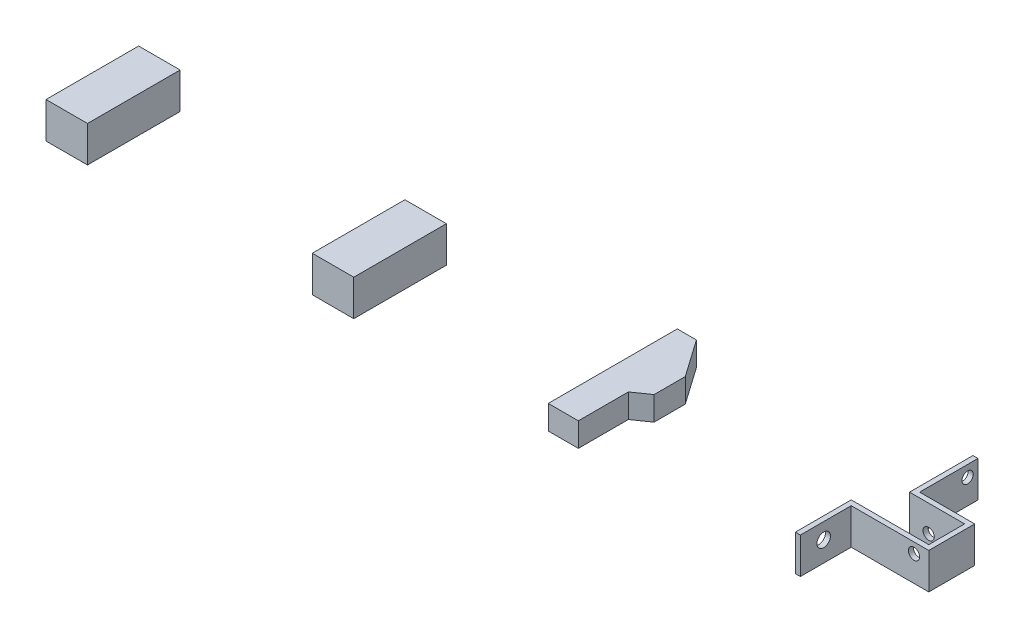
from build123d import *

# Parameters (mm, degrees)
SKETCH10_W          = 104.860369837
SKETCH10_H          = 234.156165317
EXTRUDE2_DEPTH      = 90.932
SKETCH12_W          = 104.860369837
SKETCH12_H          = 234.156165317
EXTRUDE3_DEPTH      = 90.932
EXTRUDE4_DEPTH      = 60.452
EXTRUDE_THIN1_DEPTH = 90.932
SKETCH19_R          = 17.151740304
CUT_EXTRUDE1_DEPTH  = 12.7
SKETCH20_R          = 14.265938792
CUT_EXTRUDE2_DEPTH  = 12.7
SKETCH21_R          = 14.265938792
CUT_EXTRUDE3_DEPTH  = 12.7
SKETCH22_R          = 14.265938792
CUT_EXTRUDE4_DEPTH  = 12.7


with BuildPart() as part:
    # Sketch10 → Extrude2 (new body)
    with BuildSketch(Plane(origin=(0, 0, 0), x_dir=(1, 0, 0), z_dir=(0, 1, 0))):
        with Locations((896.393212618, 117.078082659)):
            Rectangle(SKETCH10_W, SKETCH10_H)
    extrude(amount=EXTRUDE2_DEPTH)


with BuildPart() as body_2:
    # Sketch12 → Extrude3 (new body)
    with BuildSketch(Plane(origin=(0, 0, 0), x_dir=(1, 0, 0), z_dir=(0, 1, 0))):
        with Locations((1569.377756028, 117.078082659)):
            Rectangle(SKETCH12_W, SKETCH12_H)
    extrude(amount=EXTRUDE3_DEPTH)


with BuildPart() as body_3:
    # Sketch14 → Extrude4 (new body)
    with BuildSketch(Plane(origin=(0, 0, 0), x_dir=(1, 0, 0), z_dir=(0, 1, 0))):
        Polygon((2113.431738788, 0), (2113.431738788, 326.147578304), (2161.804490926, 326.147578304), (2227.78006703, 231.982473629), (2227.78006703, 153.142421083), (2189.492645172, 126.316828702), (2189.492645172, 0), align=None)
    extrude(amount=EXTRUDE4_DEPTH)


with BuildPart() as body_4:
    # Sketch18 → Extrude-Thin1 (new body)
    with BuildSketch(Plane(origin=(0, 0, 0), x_dir=(1, 0, 0), z_dir=(0, 1, 0))):
        Polygon((2737.907897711, 0), (2737.907897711, 141.242708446), (2933.942837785, 141.242708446), (2933.942837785, 231.918070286), (2794.732768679, 231.918070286), (2794.732768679, 392.203098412), (2807.432768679, 392.203098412), (2807.432768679, 244.618070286), (2946.642837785, 244.618070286), (2946.642837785, 128.542708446), (2750.607897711, 128.542708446), (2750.607897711, 0), align=None)
    extrude(amount=EXTRUDE_THIN1_DEPTH)

    # Sketch19 → Cut-Extrude1 (cut)
    with BuildSketch(Plane(origin=(2750.607897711, 0, 0), x_dir=(0, 0, -1), z_dir=(1, 0, 0))):
        with Locations((58.925139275, 50.877692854)):
            Circle(SKETCH19_R)
    extrude(amount=-CUT_EXTRUDE1_DEPTH, mode=Mode.SUBTRACT)

    # Sketch20 → Cut-Extrude2 (cut)
    with BuildSketch(Plane.XY.offset(-128.542708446)):
        with Locations((2909.268930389, 65.038185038)):
            Circle(SKETCH20_R)
    extrude(amount=-CUT_EXTRUDE2_DEPTH, mode=Mode.SUBTRACT)

    # Sketch21 → Cut-Extrude3 (cut)
    with BuildSketch(Plane(origin=(71.617529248, 14.702047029, -231.918070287), x_dir=(1, 0, 0), z_dir=(0, 0, 1))):
        with Locations((2771.345024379, 9.247328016)):
            Circle(SKETCH21_R)
    extrude(amount=-CUT_EXTRUDE3_DEPTH, mode=Mode.SUBTRACT)

    # Sketch22 → Cut-Extrude4 (cut)
    with BuildSketch(Plane(origin=(2807.432768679, -4.198558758, 2466.24499163), x_dir=(0, 0, -1), z_dir=(1, 0, 0))):
        with Locations((2832.237036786, 66.589056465)):
            Circle(SKETCH22_R)
    extrude(amount=-CUT_EXTRUDE4_DEPTH, mode=Mode.SUBTRACT)


solid = Compound([part.part, body_2.part, body_3.part, body_4.part])
